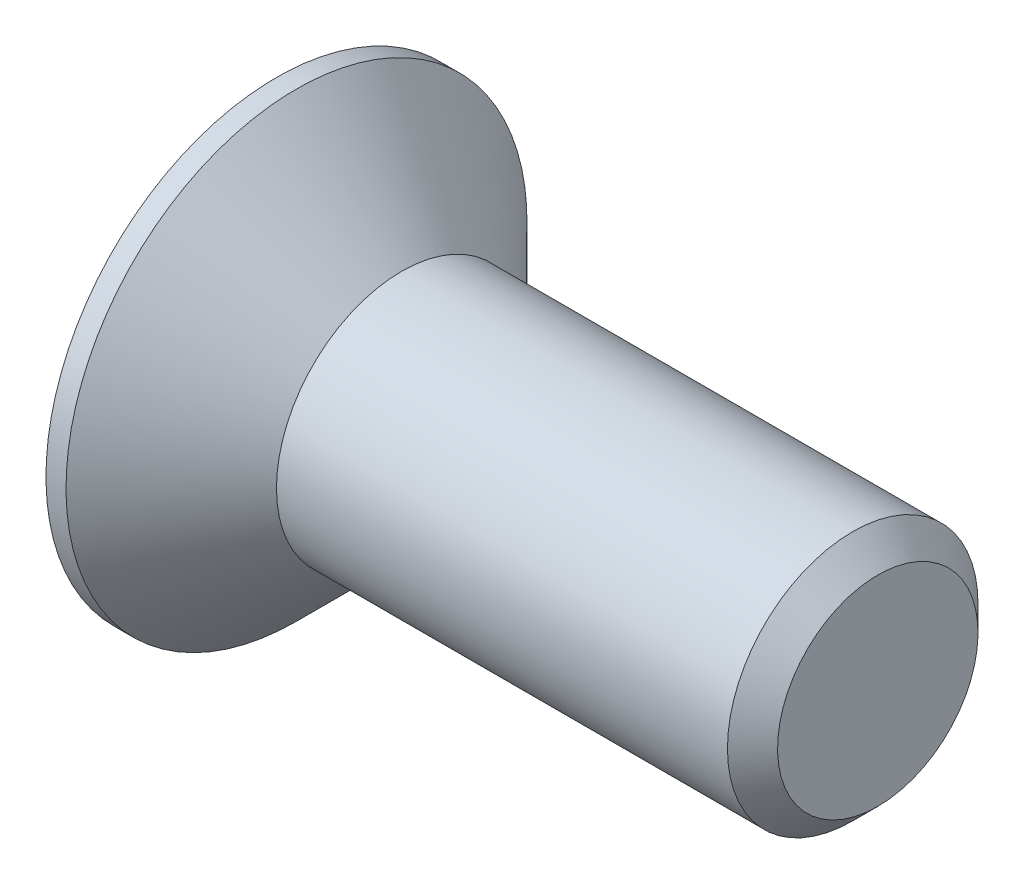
ISO-10303-21;
HEADER;
FILE_DESCRIPTION(('STEP AP214'),'2;1');
FILE_NAME('part.step','',(''),(''),'','','');
FILE_SCHEMA(('AUTOMOTIVE_DESIGN { 1 0 10303 214 1 1 1 1 }'));
ENDSEC;
DATA;
#1=APPLICATION_CONTEXT('core data for automotive mechanical design processes');
#2=APPLICATION_PROTOCOL_DEFINITION('international standard','automotive_design',2000,#1);
#3=PRODUCT_CONTEXT('',#1,'mechanical');
#4=PRODUCT('Part','Part','',(#3));
#5=PRODUCT_RELATED_PRODUCT_CATEGORY('part','',(#4));
#6=PRODUCT_DEFINITION_FORMATION('','',#4);
#7=PRODUCT_DEFINITION_CONTEXT('part definition',#1,'design');
#8=PRODUCT_DEFINITION('design','',#6,#7);
#9=PRODUCT_DEFINITION_SHAPE('','',#8);
#10=(LENGTH_UNIT() NAMED_UNIT(*) SI_UNIT(.MILLI.,.METRE.));
#11=(NAMED_UNIT(*) PLANE_ANGLE_UNIT() SI_UNIT($,.RADIAN.));
#12=(NAMED_UNIT(*) SI_UNIT($,.STERADIAN.) SOLID_ANGLE_UNIT());
#13=UNCERTAINTY_MEASURE_WITH_UNIT(LENGTH_MEASURE(1.E-05),#10,'distance_accuracy_value','');
#14=(GEOMETRIC_REPRESENTATION_CONTEXT(3) GLOBAL_UNCERTAINTY_ASSIGNED_CONTEXT((#13)) GLOBAL_UNIT_ASSIGNED_CONTEXT((#10,
#11,#12)) REPRESENTATION_CONTEXT('',''));
#15=CARTESIAN_POINT('',(0.,0.,0.));
#16=DIRECTION('',(0.,0.,1.));
#17=DIRECTION('',(1.,0.,0.));
#18=AXIS2_PLACEMENT_3D('',#15,#16,#17);
#19=CARTESIAN_POINT('',(0.,0.,0.));
#20=DIRECTION('',(-1.,0.,0.));
#21=DIRECTION('',(0.,-1.,0.));
#22=AXIS2_PLACEMENT_3D('',#19,#20,#21);
#23=CONICAL_SURFACE('',#22,2.5,0.78539816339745);
#24=CARTESIAN_POINT('',(-2.09999999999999,0.,0.));
#25=DIRECTION('',(-1.,0.,0.));
#26=DIRECTION('',(0.,-1.,0.));
#27=AXIS2_PLACEMENT_3D('',#24,#25,#26);
#28=CIRCLE('',#27,4.6);
#29=CARTESIAN_POINT('',(-2.09999999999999,-4.6,0.));
#30=VERTEX_POINT('',#29);
#31=EDGE_CURVE('E189',#30,#30,#28,.T.);
#32=ORIENTED_EDGE('',*,*,#31,.F.);
#33=EDGE_LOOP('',(#32));
#34=FACE_BOUND('',#33,.T.);
#35=CARTESIAN_POINT('',(0.,0.,0.));
#36=DIRECTION('',(-1.,0.,0.));
#37=DIRECTION('',(0.,-1.,0.));
#38=AXIS2_PLACEMENT_3D('',#35,#36,#37);
#39=CIRCLE('',#38,2.5);
#40=CARTESIAN_POINT('',(0.,-2.5,0.));
#41=VERTEX_POINT('',#40);
#42=EDGE_CURVE('E212',#41,#41,#39,.T.);
#43=ORIENTED_EDGE('',*,*,#42,.T.);
#44=EDGE_LOOP('',(#43));
#45=FACE_BOUND('',#44,.T.);
#46=ADVANCED_FACE('F33',(#34,#45),#23,.T.);
#47=CARTESIAN_POINT('',(-2.5,0.,0.));
#48=DIRECTION('',(-1.,0.,0.));
#49=DIRECTION('',(0.,-1.,0.));
#50=AXIS2_PLACEMENT_3D('',#47,#48,#49);
#51=CYLINDRICAL_SURFACE('',#50,2.5);
#52=CARTESIAN_POINT('',(9.,0.,0.));
#53=DIRECTION('',(-1.,0.,0.));
#54=DIRECTION('',(0.,-1.,0.));
#55=AXIS2_PLACEMENT_3D('',#52,#53,#54);
#56=CIRCLE('',#55,2.5);
#57=CARTESIAN_POINT('',(9.,-2.5,0.));
#58=VERTEX_POINT('',#57);
#59=EDGE_CURVE('E41',#58,#58,#56,.T.);
#60=ORIENTED_EDGE('',*,*,#59,.T.);
#61=EDGE_LOOP('',(#60));
#62=FACE_BOUND('',#61,.T.);
#63=ORIENTED_EDGE('',*,*,#42,.F.);
#64=EDGE_LOOP('',(#63));
#65=FACE_BOUND('',#64,.T.);
#66=ADVANCED_FACE('F217',(#62,#65),#51,.T.);
#67=CARTESIAN_POINT('',(9.5,0.,0.));
#68=DIRECTION('',(-1.,0.,0.));
#69=DIRECTION('',(0.,-1.,0.));
#70=AXIS2_PLACEMENT_3D('',#67,#68,#69);
#71=PLANE('',#70);
#72=CARTESIAN_POINT('',(9.5,0.,0.));
#73=DIRECTION('',(-1.,0.,0.));
#74=DIRECTION('',(0.,-1.,0.));
#75=AXIS2_PLACEMENT_3D('',#72,#73,#74);
#76=CIRCLE('',#75,2.);
#77=CARTESIAN_POINT('',(9.5,-2.,0.));
#78=VERTEX_POINT('',#77);
#79=EDGE_CURVE('E11',#78,#78,#76,.F.);
#80=ORIENTED_EDGE('',*,*,#79,.T.);
#81=EDGE_LOOP('',(#80));
#82=FACE_BOUND('',#81,.T.);
#83=ADVANCED_FACE('F239',(#82),#71,.F.);
#84=CARTESIAN_POINT('',(-2.5,4.6,0.));
#85=DIRECTION('',(1.,0.,0.));
#86=DIRECTION('',(0.,1.,0.));
#87=AXIS2_PLACEMENT_3D('',#84,#85,#86);
#88=PLANE('',#87);
#89=DIRECTION('',(0.,0.,-1.));
#90=VECTOR('',#89,1.);
#91=CARTESIAN_POINT('',(-2.5,0.575,-2.3));
#92=LINE('',#91,#90);
#93=CARTESIAN_POINT('',(-2.5,0.575,-0.575));
#94=VERTEX_POINT('',#93);
#95=CARTESIAN_POINT('',(-2.5,0.575,-2.3));
#96=VERTEX_POINT('',#95);
#97=EDGE_CURVE('E158',#94,#96,#92,.T.);
#98=ORIENTED_EDGE('',*,*,#97,.F.);
#99=DIRECTION('',(0.,-1.,0.));
#100=VECTOR('',#99,1.);
#101=CARTESIAN_POINT('',(-2.5,0.575,-0.575));
#102=LINE('',#101,#100);
#103=CARTESIAN_POINT('',(-2.5,2.3,-0.575));
#104=VERTEX_POINT('',#103);
#105=EDGE_CURVE('E48',#104,#94,#102,.T.);
#106=ORIENTED_EDGE('',*,*,#105,.F.);
#107=DIRECTION('',(0.,0.,-1.));
#108=VECTOR('',#107,1.);
#109=CARTESIAN_POINT('',(-2.5,2.3,-0.575));
#110=LINE('',#109,#108);
#111=CARTESIAN_POINT('',(-2.5,2.3,0.575));
#112=VERTEX_POINT('',#111);
#113=EDGE_CURVE('E185',#112,#104,#110,.T.);
#114=ORIENTED_EDGE('',*,*,#113,.F.);
#115=DIRECTION('',(0.,1.,0.));
#116=VECTOR('',#115,1.);
#117=CARTESIAN_POINT('',(-2.5,2.3,0.575));
#118=LINE('',#117,#116);
#119=CARTESIAN_POINT('',(-2.5,0.575,0.575));
#120=VERTEX_POINT('',#119);
#121=EDGE_CURVE('E183',#120,#112,#118,.T.);
#122=ORIENTED_EDGE('',*,*,#121,.F.);
#123=DIRECTION('',(0.,0.,-1.));
#124=VECTOR('',#123,1.);
#125=CARTESIAN_POINT('',(-2.5,0.575,0.575));
#126=LINE('',#125,#124);
#127=CARTESIAN_POINT('',(-2.5,0.575,2.3));
#128=VERTEX_POINT('',#127);
#129=EDGE_CURVE('E132',#128,#120,#126,.T.);
#130=ORIENTED_EDGE('',*,*,#129,.F.);
#131=DIRECTION('',(0.,1.,0.));
#132=VECTOR('',#131,1.);
#133=CARTESIAN_POINT('',(-2.5,0.575,2.3));
#134=LINE('',#133,#132);
#135=CARTESIAN_POINT('',(-2.5,-0.575,2.3));
#136=VERTEX_POINT('',#135);
#137=EDGE_CURVE('E179',#136,#128,#134,.T.);
#138=ORIENTED_EDGE('',*,*,#137,.F.);
#139=DIRECTION('',(0.,0.,1.));
#140=VECTOR('',#139,1.);
#141=CARTESIAN_POINT('',(-2.5,-0.575,2.3));
#142=LINE('',#141,#140);
#143=CARTESIAN_POINT('',(-2.5,-0.575,0.575));
#144=VERTEX_POINT('',#143);
#145=EDGE_CURVE('E176',#144,#136,#142,.T.);
#146=ORIENTED_EDGE('',*,*,#145,.F.);
#147=DIRECTION('',(0.,1.,0.));
#148=VECTOR('',#147,1.);
#149=CARTESIAN_POINT('',(-2.5,-0.575,0.575));
#150=LINE('',#149,#148);
#151=CARTESIAN_POINT('',(-2.5,-2.3,0.575));
#152=VERTEX_POINT('',#151);
#153=EDGE_CURVE('E173',#152,#144,#150,.T.);
#154=ORIENTED_EDGE('',*,*,#153,.F.);
#155=DIRECTION('',(0.,0.,1.));
#156=VECTOR('',#155,1.);
#157=CARTESIAN_POINT('',(-2.5,-2.3,0.575));
#158=LINE('',#157,#156);
#159=CARTESIAN_POINT('',(-2.5,-2.3,-0.575));
#160=VERTEX_POINT('',#159);
#161=EDGE_CURVE('E170',#160,#152,#158,.T.);
#162=ORIENTED_EDGE('',*,*,#161,.F.);
#163=DIRECTION('',(0.,-1.,0.));
#164=VECTOR('',#163,1.);
#165=CARTESIAN_POINT('',(-2.5,-2.3,-0.575));
#166=LINE('',#165,#164);
#167=CARTESIAN_POINT('',(-2.5,-0.575,-0.575));
#168=VERTEX_POINT('',#167);
#169=EDGE_CURVE('E167',#168,#160,#166,.T.);
#170=ORIENTED_EDGE('',*,*,#169,.F.);
#171=DIRECTION('',(0.,0.,1.));
#172=VECTOR('',#171,1.);
#173=CARTESIAN_POINT('',(-2.5,-0.575,-0.575));
#174=LINE('',#173,#172);
#175=CARTESIAN_POINT('',(-2.5,-0.575,-2.3));
#176=VERTEX_POINT('',#175);
#177=EDGE_CURVE('E164',#176,#168,#174,.T.);
#178=ORIENTED_EDGE('',*,*,#177,.F.);
#179=DIRECTION('',(0.,-1.,0.));
#180=VECTOR('',#179,1.);
#181=CARTESIAN_POINT('',(-2.5,-0.575,-2.3));
#182=LINE('',#181,#180);
#183=EDGE_CURVE('E161',#96,#176,#182,.T.);
#184=ORIENTED_EDGE('',*,*,#183,.F.);
#185=EDGE_LOOP('',(#98,#106,#114,#122,#130,#138,#146,#154,#162,#170,#178,#184));
#186=FACE_BOUND('',#185,.T.);
#187=CARTESIAN_POINT('',(-2.5,0.,0.));
#188=DIRECTION('',(-1.,0.,0.));
#189=DIRECTION('',(0.,-1.,0.));
#190=AXIS2_PLACEMENT_3D('',#187,#188,#189);
#191=CIRCLE('',#190,4.6);
#192=CARTESIAN_POINT('',(-2.5,-4.6,0.));
#193=VERTEX_POINT('',#192);
#194=EDGE_CURVE('E209',#193,#193,#191,.T.);
#195=ORIENTED_EDGE('',*,*,#194,.T.);
#196=EDGE_LOOP('',(#195));
#197=FACE_BOUND('',#196,.T.);
#198=ADVANCED_FACE('F230',(#186,#197),#88,.F.);
#199=CARTESIAN_POINT('',(-2.5,0.,0.));
#200=DIRECTION('',(-1.,0.,0.));
#201=DIRECTION('',(0.,-1.,0.));
#202=AXIS2_PLACEMENT_3D('',#199,#200,#201);
#203=CYLINDRICAL_SURFACE('',#202,4.6);
#204=ORIENTED_EDGE('',*,*,#194,.F.);
#205=EDGE_LOOP('',(#204));
#206=FACE_BOUND('',#205,.T.);
#207=ORIENTED_EDGE('',*,*,#31,.T.);
#208=EDGE_LOOP('',(#207));
#209=FACE_BOUND('',#208,.T.);
#210=ADVANCED_FACE('F222',(#206,#209),#203,.T.);
#211=CARTESIAN_POINT('',(9.,0.,0.));
#212=DIRECTION('',(-1.,0.,0.));
#213=DIRECTION('',(0.,-1.,0.));
#214=AXIS2_PLACEMENT_3D('',#211,#212,#213);
#215=CONICAL_SURFACE('',#214,2.5,0.785398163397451);
#216=ORIENTED_EDGE('',*,*,#79,.F.);
#217=EDGE_LOOP('',(#216));
#218=FACE_BOUND('',#217,.T.);
#219=ORIENTED_EDGE('',*,*,#59,.F.);
#220=EDGE_LOOP('',(#219));
#221=FACE_BOUND('',#220,.T.);
#222=ADVANCED_FACE('F35',(#218,#221),#215,.T.);
#223=CARTESIAN_POINT('',(-0.4,0.575,-0.575));
#224=DIRECTION('',(0.,0.,-1.));
#225=DIRECTION('',(-1.,0.,0.));
#226=AXIS2_PLACEMENT_3D('',#223,#224,#225);
#227=PLANE('',#226);
#228=ORIENTED_EDGE('',*,*,#105,.T.);
#229=DIRECTION('',(-1.,0.,0.));
#230=VECTOR('',#229,1.);
#231=CARTESIAN_POINT('',(-0.4,0.575,-0.575));
#232=LINE('',#231,#230);
#233=CARTESIAN_POINT('',(-0.4,0.575,-0.575));
#234=VERTEX_POINT('',#233);
#235=EDGE_CURVE('E96',#234,#94,#232,.T.);
#236=ORIENTED_EDGE('',*,*,#235,.F.);
#237=DIRECTION('',(0.,-1.,0.));
#238=VECTOR('',#237,1.);
#239=CARTESIAN_POINT('',(-0.4,0.575,-0.575));
#240=LINE('',#239,#238);
#241=CARTESIAN_POINT('',(-0.4,2.3,-0.575));
#242=VERTEX_POINT('',#241);
#243=EDGE_CURVE('E187',#242,#234,#240,.T.);
#244=ORIENTED_EDGE('',*,*,#243,.F.);
#245=DIRECTION('',(-1.,0.,0.));
#246=VECTOR('',#245,1.);
#247=CARTESIAN_POINT('',(-0.4,2.3,-0.575));
#248=LINE('',#247,#246);
#249=EDGE_CURVE('E56',#242,#104,#248,.T.);
#250=ORIENTED_EDGE('',*,*,#249,.T.);
#251=EDGE_LOOP('',(#228,#236,#244,#250));
#252=FACE_BOUND('',#251,.T.);
#253=ADVANCED_FACE('F221',(#252),#227,.F.);
#254=CARTESIAN_POINT('',(-0.4,2.3,-0.575));
#255=DIRECTION('',(0.,1.,0.));
#256=DIRECTION('',(-1.,0.,0.));
#257=AXIS2_PLACEMENT_3D('',#254,#255,#256);
#258=PLANE('',#257);
#259=ORIENTED_EDGE('',*,*,#113,.T.);
#260=ORIENTED_EDGE('',*,*,#249,.F.);
#261=DIRECTION('',(0.,0.,-1.));
#262=VECTOR('',#261,1.);
#263=CARTESIAN_POINT('',(-0.4,2.3,-0.575));
#264=LINE('',#263,#262);
#265=CARTESIAN_POINT('',(-0.4,2.3,0.575));
#266=VERTEX_POINT('',#265);
#267=EDGE_CURVE('E144',#266,#242,#264,.T.);
#268=ORIENTED_EDGE('',*,*,#267,.F.);
#269=DIRECTION('',(-1.,0.,0.));
#270=VECTOR('',#269,1.);
#271=CARTESIAN_POINT('',(-0.4,2.3,0.575));
#272=LINE('',#271,#270);
#273=EDGE_CURVE('E136',#266,#112,#272,.T.);
#274=ORIENTED_EDGE('',*,*,#273,.T.);
#275=EDGE_LOOP('',(#259,#260,#268,#274));
#276=FACE_BOUND('',#275,.T.);
#277=ADVANCED_FACE('F228',(#276),#258,.F.);
#278=CARTESIAN_POINT('',(-0.4,2.3,0.575));
#279=DIRECTION('',(0.,0.,1.));
#280=DIRECTION('',(1.,0.,0.));
#281=AXIS2_PLACEMENT_3D('',#278,#279,#280);
#282=PLANE('',#281);
#283=ORIENTED_EDGE('',*,*,#121,.T.);
#284=ORIENTED_EDGE('',*,*,#273,.F.);
#285=DIRECTION('',(0.,1.,0.));
#286=VECTOR('',#285,1.);
#287=CARTESIAN_POINT('',(-0.4,2.3,0.575));
#288=LINE('',#287,#286);
#289=CARTESIAN_POINT('',(-0.4,0.575,0.575));
#290=VERTEX_POINT('',#289);
#291=EDGE_CURVE('E140',#290,#266,#288,.T.);
#292=ORIENTED_EDGE('',*,*,#291,.F.);
#293=DIRECTION('',(-1.,0.,0.));
#294=VECTOR('',#293,1.);
#295=CARTESIAN_POINT('',(-0.4,0.575,0.575));
#296=LINE('',#295,#294);
#297=EDGE_CURVE('E125',#290,#120,#296,.T.);
#298=ORIENTED_EDGE('',*,*,#297,.T.);
#299=EDGE_LOOP('',(#283,#284,#292,#298));
#300=FACE_BOUND('',#299,.T.);
#301=ADVANCED_FACE('F141',(#300),#282,.F.);
#302=CARTESIAN_POINT('',(-0.4,0.575,0.575));
#303=DIRECTION('',(0.,1.,0.));
#304=DIRECTION('',(-1.,0.,0.));
#305=AXIS2_PLACEMENT_3D('',#302,#303,#304);
#306=PLANE('',#305);
#307=ORIENTED_EDGE('',*,*,#129,.T.);
#308=ORIENTED_EDGE('',*,*,#297,.F.);
#309=DIRECTION('',(0.,0.,-1.));
#310=VECTOR('',#309,1.);
#311=CARTESIAN_POINT('',(-0.4,0.575,0.575));
#312=LINE('',#311,#310);
#313=CARTESIAN_POINT('',(-0.4,0.575,2.3));
#314=VERTEX_POINT('',#313);
#315=EDGE_CURVE('E129',#314,#290,#312,.T.);
#316=ORIENTED_EDGE('',*,*,#315,.F.);
#317=DIRECTION('',(-1.,0.,0.));
#318=VECTOR('',#317,1.);
#319=CARTESIAN_POINT('',(-0.4,0.575,2.3));
#320=LINE('',#319,#318);
#321=EDGE_CURVE('E137',#314,#128,#320,.T.);
#322=ORIENTED_EDGE('',*,*,#321,.T.);
#323=EDGE_LOOP('',(#307,#308,#316,#322));
#324=FACE_BOUND('',#323,.T.);
#325=ADVANCED_FACE('F127',(#324),#306,.F.);
#326=CARTESIAN_POINT('',(-0.4,0.575,2.3));
#327=DIRECTION('',(0.,0.,1.));
#328=DIRECTION('',(1.,0.,0.));
#329=AXIS2_PLACEMENT_3D('',#326,#327,#328);
#330=PLANE('',#329);
#331=ORIENTED_EDGE('',*,*,#137,.T.);
#332=ORIENTED_EDGE('',*,*,#321,.F.);
#333=DIRECTION('',(0.,1.,0.));
#334=VECTOR('',#333,1.);
#335=CARTESIAN_POINT('',(-0.4,0.575,2.3));
#336=LINE('',#335,#334);
#337=CARTESIAN_POINT('',(-0.4,-0.575,2.3));
#338=VERTEX_POINT('',#337);
#339=EDGE_CURVE('E150',#338,#314,#336,.T.);
#340=ORIENTED_EDGE('',*,*,#339,.F.);
#341=DIRECTION('',(-1.,0.,0.));
#342=VECTOR('',#341,1.);
#343=CARTESIAN_POINT('',(-0.4,-0.575,2.3));
#344=LINE('',#343,#342);
#345=EDGE_CURVE('E192',#338,#136,#344,.T.);
#346=ORIENTED_EDGE('',*,*,#345,.T.);
#347=EDGE_LOOP('',(#331,#332,#340,#346));
#348=FACE_BOUND('',#347,.T.);
#349=ADVANCED_FACE('F277',(#348),#330,.F.);
#350=CARTESIAN_POINT('',(-0.4,-0.575,2.3));
#351=DIRECTION('',(0.,-1.,0.));
#352=DIRECTION('',(1.,0.,0.));
#353=AXIS2_PLACEMENT_3D('',#350,#351,#352);
#354=PLANE('',#353);
#355=ORIENTED_EDGE('',*,*,#145,.T.);
#356=ORIENTED_EDGE('',*,*,#345,.F.);
#357=DIRECTION('',(0.,0.,1.));
#358=VECTOR('',#357,1.);
#359=CARTESIAN_POINT('',(-0.4,-0.575,2.3));
#360=LINE('',#359,#358);
#361=CARTESIAN_POINT('',(-0.4,-0.575,0.575));
#362=VERTEX_POINT('',#361);
#363=EDGE_CURVE('E152',#362,#338,#360,.T.);
#364=ORIENTED_EDGE('',*,*,#363,.F.);
#365=DIRECTION('',(-1.,0.,0.));
#366=VECTOR('',#365,1.);
#367=CARTESIAN_POINT('',(-0.4,-0.575,0.575));
#368=LINE('',#367,#366);
#369=EDGE_CURVE('E194',#362,#144,#368,.T.);
#370=ORIENTED_EDGE('',*,*,#369,.T.);
#371=EDGE_LOOP('',(#355,#356,#364,#370));
#372=FACE_BOUND('',#371,.T.);
#373=ADVANCED_FACE('F273',(#372),#354,.F.);
#374=CARTESIAN_POINT('',(-0.4,-0.575,0.575));
#375=DIRECTION('',(0.,0.,1.));
#376=DIRECTION('',(1.,0.,0.));
#377=AXIS2_PLACEMENT_3D('',#374,#375,#376);
#378=PLANE('',#377);
#379=ORIENTED_EDGE('',*,*,#153,.T.);
#380=ORIENTED_EDGE('',*,*,#369,.F.);
#381=DIRECTION('',(0.,1.,0.));
#382=VECTOR('',#381,1.);
#383=CARTESIAN_POINT('',(-0.4,-0.575,0.575));
#384=LINE('',#383,#382);
#385=CARTESIAN_POINT('',(-0.4,-2.3,0.575));
#386=VERTEX_POINT('',#385);
#387=EDGE_CURVE('E422',#386,#362,#384,.T.);
#388=ORIENTED_EDGE('',*,*,#387,.F.);
#389=DIRECTION('',(-1.,0.,0.));
#390=VECTOR('',#389,1.);
#391=CARTESIAN_POINT('',(-0.4,-2.3,0.575));
#392=LINE('',#391,#390);
#393=EDGE_CURVE('E196',#386,#152,#392,.T.);
#394=ORIENTED_EDGE('',*,*,#393,.T.);
#395=EDGE_LOOP('',(#379,#380,#388,#394));
#396=FACE_BOUND('',#395,.T.);
#397=ADVANCED_FACE('F269',(#396),#378,.F.);
#398=CARTESIAN_POINT('',(-0.4,-2.3,0.575));
#399=DIRECTION('',(0.,-1.,0.));
#400=DIRECTION('',(1.,0.,0.));
#401=AXIS2_PLACEMENT_3D('',#398,#399,#400);
#402=PLANE('',#401);
#403=ORIENTED_EDGE('',*,*,#161,.T.);
#404=ORIENTED_EDGE('',*,*,#393,.F.);
#405=DIRECTION('',(0.,0.,1.));
#406=VECTOR('',#405,1.);
#407=CARTESIAN_POINT('',(-0.4,-2.3,0.575));
#408=LINE('',#407,#406);
#409=CARTESIAN_POINT('',(-0.4,-2.3,-0.575));
#410=VERTEX_POINT('',#409);
#411=EDGE_CURVE('E419',#410,#386,#408,.T.);
#412=ORIENTED_EDGE('',*,*,#411,.F.);
#413=DIRECTION('',(-1.,0.,0.));
#414=VECTOR('',#413,1.);
#415=CARTESIAN_POINT('',(-0.4,-2.3,-0.575));
#416=LINE('',#415,#414);
#417=EDGE_CURVE('E198',#410,#160,#416,.T.);
#418=ORIENTED_EDGE('',*,*,#417,.T.);
#419=EDGE_LOOP('',(#403,#404,#412,#418));
#420=FACE_BOUND('',#419,.T.);
#421=ADVANCED_FACE('F265',(#420),#402,.F.);
#422=CARTESIAN_POINT('',(-0.4,-2.3,-0.575));
#423=DIRECTION('',(0.,0.,-1.));
#424=DIRECTION('',(-1.,0.,0.));
#425=AXIS2_PLACEMENT_3D('',#422,#423,#424);
#426=PLANE('',#425);
#427=ORIENTED_EDGE('',*,*,#169,.T.);
#428=ORIENTED_EDGE('',*,*,#417,.F.);
#429=DIRECTION('',(0.,-1.,0.));
#430=VECTOR('',#429,1.);
#431=CARTESIAN_POINT('',(-0.4,-2.3,-0.575));
#432=LINE('',#431,#430);
#433=CARTESIAN_POINT('',(-0.4,-0.575,-0.575));
#434=VERTEX_POINT('',#433);
#435=EDGE_CURVE('E416',#434,#410,#432,.T.);
#436=ORIENTED_EDGE('',*,*,#435,.F.);
#437=DIRECTION('',(-1.,0.,0.));
#438=VECTOR('',#437,1.);
#439=CARTESIAN_POINT('',(-0.4,-0.575,-0.575));
#440=LINE('',#439,#438);
#441=EDGE_CURVE('E200',#434,#168,#440,.T.);
#442=ORIENTED_EDGE('',*,*,#441,.T.);
#443=EDGE_LOOP('',(#427,#428,#436,#442));
#444=FACE_BOUND('',#443,.T.);
#445=ADVANCED_FACE('F261',(#444),#426,.F.);
#446=CARTESIAN_POINT('',(-0.4,-0.575,-0.575));
#447=DIRECTION('',(0.,-1.,0.));
#448=DIRECTION('',(1.,0.,0.));
#449=AXIS2_PLACEMENT_3D('',#446,#447,#448);
#450=PLANE('',#449);
#451=ORIENTED_EDGE('',*,*,#177,.T.);
#452=ORIENTED_EDGE('',*,*,#441,.F.);
#453=DIRECTION('',(0.,0.,1.));
#454=VECTOR('',#453,1.);
#455=CARTESIAN_POINT('',(-0.4,-0.575,-0.575));
#456=LINE('',#455,#454);
#457=CARTESIAN_POINT('',(-0.4,-0.575,-2.3));
#458=VERTEX_POINT('',#457);
#459=EDGE_CURVE('E413',#458,#434,#456,.T.);
#460=ORIENTED_EDGE('',*,*,#459,.F.);
#461=DIRECTION('',(-1.,0.,0.));
#462=VECTOR('',#461,1.);
#463=CARTESIAN_POINT('',(-0.4,-0.575,-2.3));
#464=LINE('',#463,#462);
#465=EDGE_CURVE('E202',#458,#176,#464,.T.);
#466=ORIENTED_EDGE('',*,*,#465,.T.);
#467=EDGE_LOOP('',(#451,#452,#460,#466));
#468=FACE_BOUND('',#467,.T.);
#469=ADVANCED_FACE('F257',(#468),#450,.F.);
#470=CARTESIAN_POINT('',(-0.4,-0.575,-2.3));
#471=DIRECTION('',(0.,0.,-1.));
#472=DIRECTION('',(-1.,0.,0.));
#473=AXIS2_PLACEMENT_3D('',#470,#471,#472);
#474=PLANE('',#473);
#475=ORIENTED_EDGE('',*,*,#183,.T.);
#476=ORIENTED_EDGE('',*,*,#465,.F.);
#477=DIRECTION('',(0.,-1.,0.));
#478=VECTOR('',#477,1.);
#479=CARTESIAN_POINT('',(-0.4,-0.575,-2.3));
#480=LINE('',#479,#478);
#481=CARTESIAN_POINT('',(-0.4,0.575,-2.3));
#482=VERTEX_POINT('',#481);
#483=EDGE_CURVE('E408',#482,#458,#480,.T.);
#484=ORIENTED_EDGE('',*,*,#483,.F.);
#485=DIRECTION('',(-1.,0.,0.));
#486=VECTOR('',#485,1.);
#487=CARTESIAN_POINT('',(-0.4,0.575,-2.3));
#488=LINE('',#487,#486);
#489=EDGE_CURVE('E204',#482,#96,#488,.T.);
#490=ORIENTED_EDGE('',*,*,#489,.T.);
#491=EDGE_LOOP('',(#475,#476,#484,#490));
#492=FACE_BOUND('',#491,.T.);
#493=ADVANCED_FACE('F253',(#492),#474,.F.);
#494=CARTESIAN_POINT('',(-0.4,0.575,-2.3));
#495=DIRECTION('',(0.,1.,0.));
#496=DIRECTION('',(-1.,0.,0.));
#497=AXIS2_PLACEMENT_3D('',#494,#495,#496);
#498=PLANE('',#497);
#499=ORIENTED_EDGE('',*,*,#97,.T.);
#500=ORIENTED_EDGE('',*,*,#489,.F.);
#501=DIRECTION('',(0.,0.,-1.));
#502=VECTOR('',#501,1.);
#503=CARTESIAN_POINT('',(-0.4,0.575,-2.3));
#504=LINE('',#503,#502);
#505=EDGE_CURVE('E406',#234,#482,#504,.T.);
#506=ORIENTED_EDGE('',*,*,#505,.F.);
#507=ORIENTED_EDGE('',*,*,#235,.T.);
#508=EDGE_LOOP('',(#499,#500,#506,#507));
#509=FACE_BOUND('',#508,.T.);
#510=ADVANCED_FACE('F250',(#509),#498,.F.);
#511=CARTESIAN_POINT('',(-0.4,0.,0.));
#512=DIRECTION('',(1.,0.,0.));
#513=DIRECTION('',(0.,0.,-1.));
#514=AXIS2_PLACEMENT_3D('',#511,#512,#513);
#515=PLANE('',#514);
#516=ORIENTED_EDGE('',*,*,#243,.T.);
#517=ORIENTED_EDGE('',*,*,#505,.T.);
#518=ORIENTED_EDGE('',*,*,#483,.T.);
#519=ORIENTED_EDGE('',*,*,#459,.T.);
#520=ORIENTED_EDGE('',*,*,#435,.T.);
#521=ORIENTED_EDGE('',*,*,#411,.T.);
#522=ORIENTED_EDGE('',*,*,#387,.T.);
#523=ORIENTED_EDGE('',*,*,#363,.T.);
#524=ORIENTED_EDGE('',*,*,#339,.T.);
#525=ORIENTED_EDGE('',*,*,#315,.T.);
#526=ORIENTED_EDGE('',*,*,#291,.T.);
#527=ORIENTED_EDGE('',*,*,#267,.T.);
#528=EDGE_LOOP('',(#516,#517,#518,#519,#520,#521,#522,#523,#524,#525,#526,#527));
#529=FACE_BOUND('',#528,.T.);
#530=ADVANCED_FACE('F147',(#529),#515,.F.);
#531=CLOSED_SHELL('',(#46,#66,#83,#198,#210,#222,#253,#277,#301,#325,#349,#373,#397,#421,#445,
#469,#493,#510,#530));
#532=MANIFOLD_SOLID_BREP('B2',#531);
#533=ADVANCED_BREP_SHAPE_REPRESENTATION('',(#18,#532),#14);
#534=SHAPE_DEFINITION_REPRESENTATION(#9,#533);
ENDSEC;
END-ISO-10303-21;
